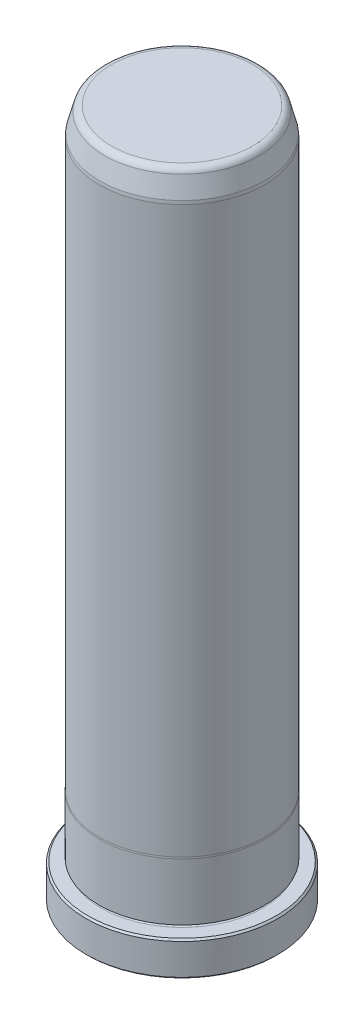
from build123d import *

# Parameters (mm, degrees)
FILLET6_R     = 1.5875
CHAMFER1_SIZE = 0.381


with BuildPart() as part:
    # Sketch1 → Revolve1 (revolve)
    with BuildSketch(Plane(origin=(0, 0, 0), x_dir=(0, 0, -1), z_dir=(1, 0, 0)), mode=Mode.PRIVATE) as revolve1_sk:
        with BuildLine():
            Line((0, 0), (22.098, 0))
            Line((22.098, 0), (22.098, 7.9248))
            Line((22.098, 7.9248), (18.6563, 7.9248))
            ThreePointArc((18.6563, 7.9248), (18.2753, 8.3058), (18.6563, 8.6868))
            Line((18.6563, 8.6868), (19.0627, 8.6868))
            Line((19.0627, 8.6868), (19.0627, 21.861763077))
            Line((19.0627, 21.861763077), (19.0373, 22.225))
            Line((19.0373, 22.225), (19.0373, 152.4))
            Line((19.0373, 152.4), (18.970633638, 153.162))
            Line((18.970633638, 153.162), (17.473333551, 158.75))
            Line((17.473333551, 158.75), (0, 158.75))
            Line((0, 158.75), (0, 0))
        make_face()
    revolve(revolve1_sk.sketch.rotate(Axis((0, 0, 0), (0, -1, 0)), 180), axis=Axis((0, 0, 0), (0, -1, 0)))

    # Fillet6
    fillet6_edges = [part.edges().sort_by_distance(p)[0] for p in [
        (0, 158.75, -17.473333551),
    ]]
    fillet(fillet6_edges, radius=FILLET6_R)

    # Chamfer1
    chamfer1_edges = [part.edges().sort_by_distance(p)[0] for p in [
        (0, 7.9248, -22.098),
        (0, 0, -22.098),
    ]]
    chamfer(chamfer1_edges, length=CHAMFER1_SIZE)


solid = part.part
